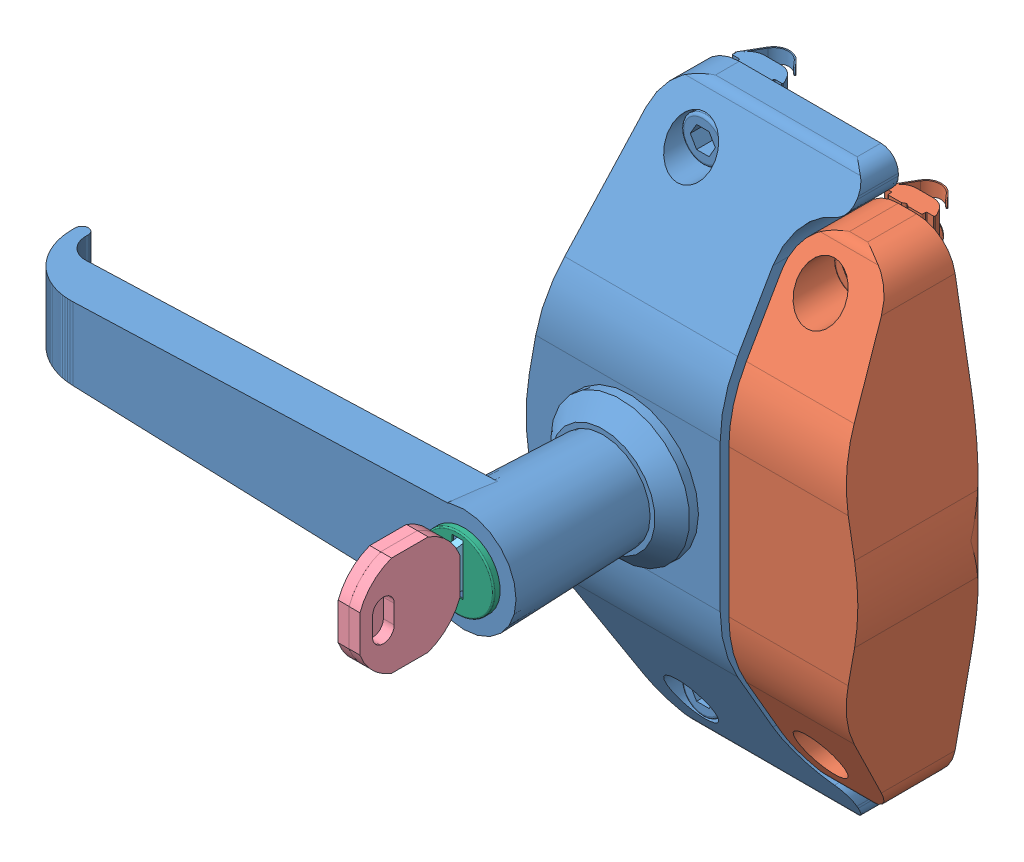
SolidWorks assembly 21.0959 SLIDING DOOR LOCK 30.SLDASM, configuration Default (file format 6000). Lengths in mm.
Overall size (157.69 130 104.46).
8 component instances, 6 part files, 11 mates.
Components (placement in the parent):
- 21.0959 SLIDING DOOR LATCH 30 HANDLE SIDE-1: 21.0959 SLIDING DOOR LATCH 30 HANDLE SIDE.SLDPRT [Default] at origin size (149 130 77.97)
- 21.0959 SLIDING DOOR LATCH 30 CATCH SIDE-1: 21.0959 SLIDING DOOR LATCH 30 CATCH SIDE.SLDPRT [Default] at origin size (29.69 110 39.97)
- 21.1758 SNAP BOLT 25-1: 21.1758 SNAP BOLT 25.SLDPRT [Default] at (35 55 26) x (0.824008 -0.566578 0) z (0 0 -1) size (8 8 25)
- 1108-U35_ASM-1: 1108-U35_ASM.sldasm [Default] at (4.05 56.65 67.9891) x (0 -1 0) z (0 0 -1) size (23 5 48)
  - 1108-15-01_PRT-1: 1108-15-01_PRT.sldprt [Default] at (0 0.9 -15) x (-1 0 0) z (0 0 1) size (23 2.5 22.99)
  - 1108-15-01_PRT-2: 1108-15-01_PRT.sldprt [Default] at (0 1.1 -15.0109) x (-1 0 0) z (0 0 -1) size (23 2.5 22.99)
  - 1108-14-333_PRT-1: 1108-14-333_PRT.sldprt [Default] at origin size (9.62 1.8 38)
- 1108-26-1: 1108-26.sldprt [Default] at (3 55 69.5) size (16.7 16.7 2.18)
Mates (geometry in assembly coordinates):
- Coincident1: coincident aligned: plane of 21.0959 SLIDING DOOR LATCH 30 HANDLE SIDE-1 through (7.525 55 0) normal (0 0 -1); plane of 21.0959 SLIDING DOOR LATCH 30 CATCH SIDE-1 through (38.7064 55 0) normal (0 0 -1)
- Distance1: distance = 10 mm aligned: plane of 21.0959 SLIDING DOOR LATCH 30 CATCH SIDE-1 through (35 110 0) normal (0 1 0); plane of 21.0959 SLIDING DOOR LATCH 30 HANDLE SIDE-1 through (-1.609 120 0) normal (0 1 0)
- Distance2: distance = 2 mm anti-aligned: plane of 21.0959 SLIDING DOOR LATCH 30 HANDLE SIDE-1 through (24 101 0) normal (1 0 0); plane of 21.0959 SLIDING DOOR LATCH 30 CATCH SIDE-1 through (26 9 0) normal (-1 0 0)
- Concentric1: concentric anti-aligned: cylinder of 21.0959 SLIDING DOOR LATCH 30 CATCH SIDE-1 through (35 55 20) axis (0 0 1) radius 3.3235; cylinder of 21.1758 SNAP BOLT 25-1 through (35 55 26) axis (0 0 -1) radius 4
- Distance3: distance = 13 mm aligned: plane of 21.0959 SLIDING DOOR LATCH 30 CATCH SIDE-1 through (38.15 55 14) normal (0 0 -1); plane of 21.1758 SNAP BOLT 25-1 through (35 55 1) normal (0 0 -1)
- Coincident2: coincident anti-aligned: plane of 21.0959 SLIDING DOOR LATCH 30 HANDLE SIDE-1 through (13 55 68) normal (0 0 1); plane of 1108-26-1 through (3 55 68) normal (0 0 -1)
- Concentric2: concentric aligned: cone of 21.0959 SLIDING DOOR LATCH 30 HANDLE SIDE-1 through (3 55 68) axis (0 0 -1); cylinder of 1108-26-1 through (3 55 69.5) axis (0 0 -1) radius 8.35
- Angle1: planar angle aligned: plane of 1108-26-1 through (4.25 50.35 69.5) normal (-1 0 0); plane of 21.0959 SLIDING DOOR LATCH 30 CATCH SIDE-1 through (26 9 0) normal (-1 0 0)
- Distance4: distance = 2 mm: plane of 1108-U35_ASM-1/1108-15-01_PRT-2 through (0.55 60.8705 71.5) normal (0 0 -1); plane of 1108-26-1 through (3 55 69.5) normal (0 0 1)
- Distance5: distance = 2 mm: plane of 1108-U35_ASM-1/1108-14-333_PRT-1 through (2.25 56.65 67.9891) normal (1 0 0); plane of 1108-26-1 through (4.25 50.35 69.5) normal (-1 0 0)
- Distance7: distance = 3 mm aligned: plane of 1108-26-1 through (1.75 50.35 69.5) normal (0 1 0); plane of 1108-U35_ASM-1/1108-14-333_PRT-1 through (4.05 53.35 48.4891) normal (0 1 0)
